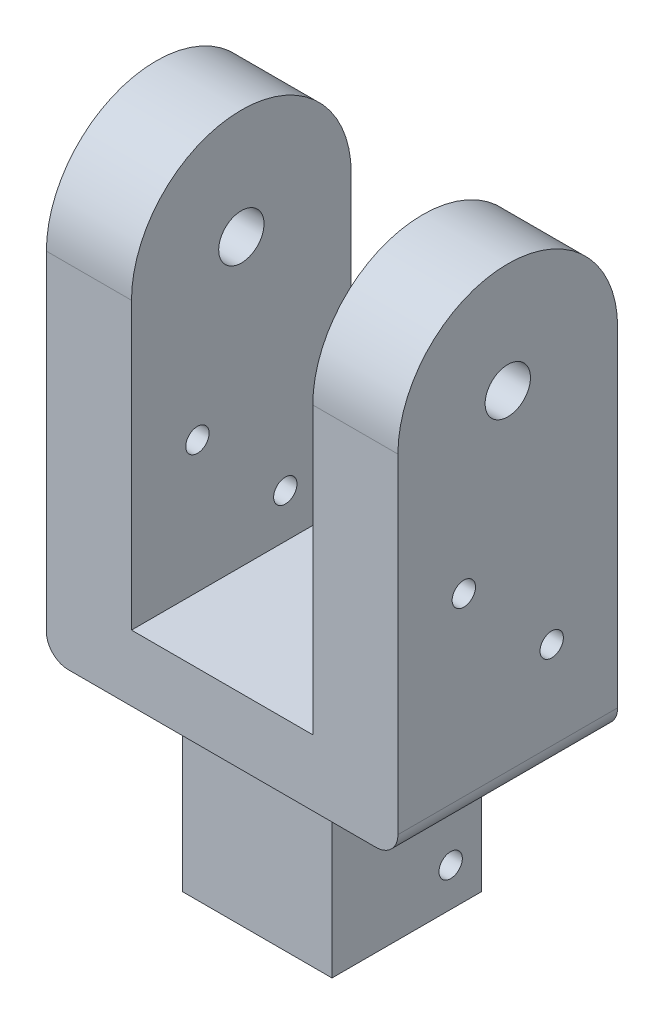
ISO-10303-21;
HEADER;
FILE_DESCRIPTION(('STEP AP214'),'2;1');
FILE_NAME('part.step','',(''),(''),'','','');
FILE_SCHEMA(('AUTOMOTIVE_DESIGN { 1 0 10303 214 1 1 1 1 }'));
ENDSEC;
DATA;
#1=APPLICATION_CONTEXT('core data for automotive mechanical design processes');
#2=APPLICATION_PROTOCOL_DEFINITION('international standard','automotive_design',2000,#1);
#3=PRODUCT_CONTEXT('',#1,'mechanical');
#4=PRODUCT('Part','Part','',(#3));
#5=PRODUCT_RELATED_PRODUCT_CATEGORY('part','',(#4));
#6=PRODUCT_DEFINITION_FORMATION('','',#4);
#7=PRODUCT_DEFINITION_CONTEXT('part definition',#1,'design');
#8=PRODUCT_DEFINITION('design','',#6,#7);
#9=PRODUCT_DEFINITION_SHAPE('','',#8);
#10=(LENGTH_UNIT() NAMED_UNIT(*) SI_UNIT(.MILLI.,.METRE.));
#11=(NAMED_UNIT(*) PLANE_ANGLE_UNIT() SI_UNIT($,.RADIAN.));
#12=(NAMED_UNIT(*) SI_UNIT($,.STERADIAN.) SOLID_ANGLE_UNIT());
#13=UNCERTAINTY_MEASURE_WITH_UNIT(LENGTH_MEASURE(1.E-05),#10,'distance_accuracy_value','');
#14=(GEOMETRIC_REPRESENTATION_CONTEXT(3) GLOBAL_UNCERTAINTY_ASSIGNED_CONTEXT((#13)) GLOBAL_UNIT_ASSIGNED_CONTEXT((#10,
#11,#12)) REPRESENTATION_CONTEXT('',''));
#15=CARTESIAN_POINT('',(0.,0.,0.));
#16=DIRECTION('',(0.,0.,1.));
#17=DIRECTION('',(1.,0.,0.));
#18=AXIS2_PLACEMENT_3D('',#15,#16,#17);
#19=CARTESIAN_POINT('',(101.6,0.,0.));
#20=DIRECTION('',(-1.,0.,0.));
#21=DIRECTION('',(0.,0.,1.));
#22=AXIS2_PLACEMENT_3D('',#19,#20,#21);
#23=CYLINDRICAL_SURFACE('',#22,31.75);
#24=DIRECTION('',(-1.,0.,0.));
#25=VECTOR('',#24,1.);
#26=CARTESIAN_POINT('',(101.6,0.,31.7499999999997));
#27=LINE('',#26,#25);
#28=CARTESIAN_POINT('',(24.6062500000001,0.,31.7499999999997));
#29=VERTEX_POINT('',#28);
#30=CARTESIAN_POINT('',(0.,0.,31.7499999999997));
#31=VERTEX_POINT('',#30);
#32=EDGE_CURVE('E239',#29,#31,#27,.T.);
#33=ORIENTED_EDGE('',*,*,#32,.F.);
#34=CARTESIAN_POINT('',(24.6062500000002,0.,0.));
#35=DIRECTION('',(-1.,0.,0.));
#36=DIRECTION('',(0.,-1.,0.));
#37=AXIS2_PLACEMENT_3D('',#34,#35,#36);
#38=CIRCLE('',#37,31.75);
#39=CARTESIAN_POINT('',(24.6062500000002,0.,-31.7499999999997));
#40=VERTEX_POINT('',#39);
#41=EDGE_CURVE('E188',#29,#40,#38,.T.);
#42=ORIENTED_EDGE('',*,*,#41,.T.);
#43=DIRECTION('',(-1.,0.,0.));
#44=VECTOR('',#43,1.);
#45=CARTESIAN_POINT('',(101.6,0.,-31.7499999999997));
#46=LINE('',#45,#44);
#47=CARTESIAN_POINT('',(1.11022302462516E-13,0.,-31.7499999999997));
#48=VERTEX_POINT('',#47);
#49=EDGE_CURVE('E169',#40,#48,#46,.T.);
#50=ORIENTED_EDGE('',*,*,#49,.T.);
#51=CARTESIAN_POINT('',(1.11022302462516E-13,0.,0.));
#52=DIRECTION('',(1.,0.,0.));
#53=DIRECTION('',(0.,0.,-1.));
#54=AXIS2_PLACEMENT_3D('',#51,#52,#53);
#55=CIRCLE('',#54,31.75);
#56=EDGE_CURVE('E218',#48,#31,#55,.T.);
#57=ORIENTED_EDGE('',*,*,#56,.T.);
#58=EDGE_LOOP('',(#33,#42,#50,#57));
#59=FACE_BOUND('',#58,.T.);
#60=ADVANCED_FACE('F30',(#59),#23,.T.);
#61=CARTESIAN_POINT('',(101.6,0.,0.));
#62=DIRECTION('',(-1.,0.,0.));
#63=DIRECTION('',(0.,0.,1.));
#64=AXIS2_PLACEMENT_3D('',#61,#62,#63);
#65=CYLINDRICAL_SURFACE('',#64,6.54812);
#66=CARTESIAN_POINT('',(24.6062500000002,0.,0.));
#67=DIRECTION('',(-1.,0.,0.));
#68=DIRECTION('',(0.,-1.,0.));
#69=AXIS2_PLACEMENT_3D('',#66,#67,#68);
#70=CIRCLE('',#69,6.54812);
#71=CARTESIAN_POINT('',(24.6062500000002,-6.54812000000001,0.));
#72=VERTEX_POINT('',#71);
#73=EDGE_CURVE('E187',#72,#72,#70,.T.);
#74=ORIENTED_EDGE('',*,*,#73,.F.);
#75=EDGE_LOOP('',(#74));
#76=FACE_BOUND('',#75,.T.);
#77=CARTESIAN_POINT('',(1.11022302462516E-13,0.,0.));
#78=DIRECTION('',(1.,0.,0.));
#79=DIRECTION('',(0.,0.,-1.));
#80=AXIS2_PLACEMENT_3D('',#77,#78,#79);
#81=CIRCLE('',#80,6.54812);
#82=CARTESIAN_POINT('',(1.11015226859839E-13,0.,-6.54812));
#83=VERTEX_POINT('',#82);
#84=EDGE_CURVE('E214',#83,#83,#81,.T.);
#85=ORIENTED_EDGE('',*,*,#84,.F.);
#86=EDGE_LOOP('',(#85));
#87=FACE_BOUND('',#86,.T.);
#88=ADVANCED_FACE('F363',(#76,#87),#65,.F.);
#89=CARTESIAN_POINT('',(101.6,0.,0.));
#90=DIRECTION('',(1.,0.,0.));
#91=DIRECTION('',(0.,0.,-1.));
#92=AXIS2_PLACEMENT_3D('',#89,#90,#91);
#93=PLANE('',#92);
#94=CARTESIAN_POINT('',(101.6,-69.85,-12.6999999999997));
#95=DIRECTION('',(-1.,0.,0.));
#96=DIRECTION('',(0.,0.,1.));
#97=AXIS2_PLACEMENT_3D('',#94,#95,#96);
#98=CIRCLE('',#97,3.37312);
#99=CARTESIAN_POINT('',(101.6,-69.85,-9.32687999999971));
#100=VERTEX_POINT('',#99);
#101=EDGE_CURVE('E559',#100,#100,#98,.T.);
#102=ORIENTED_EDGE('',*,*,#101,.T.);
#103=EDGE_LOOP('',(#102));
#104=FACE_BOUND('',#103,.T.);
#105=CARTESIAN_POINT('',(101.6,-44.45,12.6999999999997));
#106=DIRECTION('',(-1.,0.,0.));
#107=DIRECTION('',(0.,0.,1.));
#108=AXIS2_PLACEMENT_3D('',#105,#106,#107);
#109=CIRCLE('',#108,3.37312);
#110=CARTESIAN_POINT('',(101.6,-44.45,16.0731199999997));
#111=VERTEX_POINT('',#110);
#112=EDGE_CURVE('E300',#111,#111,#109,.T.);
#113=ORIENTED_EDGE('',*,*,#112,.T.);
#114=EDGE_LOOP('',(#113));
#115=FACE_BOUND('',#114,.T.);
#116=CARTESIAN_POINT('',(101.6,0.,0.));
#117=DIRECTION('',(1.,0.,0.));
#118=DIRECTION('',(0.,0.,-1.));
#119=AXIS2_PLACEMENT_3D('',#116,#117,#118);
#120=CIRCLE('',#119,6.54812);
#121=CARTESIAN_POINT('',(101.6,0.,-6.54812));
#122=VERTEX_POINT('',#121);
#123=EDGE_CURVE('E215',#122,#122,#120,.T.);
#124=ORIENTED_EDGE('',*,*,#123,.F.);
#125=EDGE_LOOP('',(#124));
#126=FACE_BOUND('',#125,.T.);
#127=DIRECTION('',(0.,-1.,0.));
#128=VECTOR('',#127,1.);
#129=CARTESIAN_POINT('',(101.6,0.,31.7499999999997));
#130=LINE('',#129,#128);
#131=CARTESIAN_POINT('',(101.6,0.,31.7499999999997));
#132=VERTEX_POINT('',#131);
#133=CARTESIAN_POINT('',(101.6,-95.2500000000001,31.7499999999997));
#134=VERTEX_POINT('',#133);
#135=EDGE_CURVE('E224',#132,#134,#130,.T.);
#136=ORIENTED_EDGE('',*,*,#135,.T.);
#137=DIRECTION('',(0.,0.,-1.));
#138=VECTOR('',#137,1.);
#139=CARTESIAN_POINT('',(101.6,-95.2500000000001,0.));
#140=LINE('',#139,#138);
#141=CARTESIAN_POINT('',(101.6,-95.2500000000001,-31.7499999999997));
#142=VERTEX_POINT('',#141);
#143=EDGE_CURVE('E246',#134,#142,#140,.T.);
#144=ORIENTED_EDGE('',*,*,#143,.T.);
#145=DIRECTION('',(0.,1.,0.));
#146=VECTOR('',#145,1.);
#147=CARTESIAN_POINT('',(101.6,0.,-31.7499999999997));
#148=LINE('',#147,#146);
#149=CARTESIAN_POINT('',(101.6,0.,-31.7499999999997));
#150=VERTEX_POINT('',#149);
#151=EDGE_CURVE('E228',#142,#150,#148,.T.);
#152=ORIENTED_EDGE('',*,*,#151,.T.);
#153=CARTESIAN_POINT('',(101.6,0.,0.));
#154=DIRECTION('',(1.,0.,0.));
#155=DIRECTION('',(0.,0.,-1.));
#156=AXIS2_PLACEMENT_3D('',#153,#154,#155);
#157=CIRCLE('',#156,31.75);
#158=EDGE_CURVE('E221',#150,#132,#157,.T.);
#159=ORIENTED_EDGE('',*,*,#158,.T.);
#160=EDGE_LOOP('',(#136,#144,#152,#159));
#161=FACE_BOUND('',#160,.T.);
#162=ADVANCED_FACE('F370',(#104,#115,#126,#161),#93,.T.);
#163=CARTESIAN_POINT('',(1.11022302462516E-13,0.,0.));
#164=DIRECTION('',(1.,0.,0.));
#165=DIRECTION('',(0.,0.,-1.));
#166=AXIS2_PLACEMENT_3D('',#163,#164,#165);
#167=PLANE('',#166);
#168=CARTESIAN_POINT('',(1.11022302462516E-13,-69.85,-12.6999999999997));
#169=DIRECTION('',(-1.,0.,0.));
#170=DIRECTION('',(0.,0.,1.));
#171=AXIS2_PLACEMENT_3D('',#168,#169,#170);
#172=CIRCLE('',#171,3.37312);
#173=CARTESIAN_POINT('',(1.11025947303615E-13,-69.85,-9.32687999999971));
#174=VERTEX_POINT('',#173);
#175=EDGE_CURVE('E555',#174,#174,#172,.T.);
#176=ORIENTED_EDGE('',*,*,#175,.F.);
#177=EDGE_LOOP('',(#176));
#178=FACE_BOUND('',#177,.T.);
#179=CARTESIAN_POINT('',(0.,-44.45,12.6999999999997));
#180=DIRECTION('',(-1.,0.,0.));
#181=DIRECTION('',(0.,0.,1.));
#182=AXIS2_PLACEMENT_3D('',#179,#180,#181);
#183=CIRCLE('',#182,3.37312);
#184=CARTESIAN_POINT('',(0.,-44.45,16.0731199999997));
#185=VERTEX_POINT('',#184);
#186=EDGE_CURVE('E306',#185,#185,#183,.T.);
#187=ORIENTED_EDGE('',*,*,#186,.F.);
#188=EDGE_LOOP('',(#187));
#189=FACE_BOUND('',#188,.T.);
#190=ORIENTED_EDGE('',*,*,#84,.T.);
#191=EDGE_LOOP('',(#190));
#192=FACE_BOUND('',#191,.T.);
#193=DIRECTION('',(0.,1.,0.));
#194=VECTOR('',#193,1.);
#195=CARTESIAN_POINT('',(1.11022302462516E-13,0.,-31.7499999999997));
#196=LINE('',#195,#194);
#197=CARTESIAN_POINT('',(1.11022302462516E-13,-95.2500000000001,-31.7499999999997));
#198=VERTEX_POINT('',#197);
#199=EDGE_CURVE('E225',#198,#48,#196,.T.);
#200=ORIENTED_EDGE('',*,*,#199,.F.);
#201=DIRECTION('',(0.,0.,-1.));
#202=VECTOR('',#201,1.);
#203=CARTESIAN_POINT('',(0.,-95.2500000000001,31.7499999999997));
#204=LINE('',#203,#202);
#205=CARTESIAN_POINT('',(0.,-95.2500000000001,31.7499999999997));
#206=VERTEX_POINT('',#205);
#207=EDGE_CURVE('E272',#198,#206,#204,.F.);
#208=ORIENTED_EDGE('',*,*,#207,.T.);
#209=DIRECTION('',(0.,-1.,0.));
#210=VECTOR('',#209,1.);
#211=CARTESIAN_POINT('',(0.,0.,31.7499999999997));
#212=LINE('',#211,#210);
#213=EDGE_CURVE('E232',#31,#206,#212,.T.);
#214=ORIENTED_EDGE('',*,*,#213,.F.);
#215=ORIENTED_EDGE('',*,*,#56,.F.);
#216=EDGE_LOOP('',(#200,#208,#214,#215));
#217=FACE_BOUND('',#216,.T.);
#218=ADVANCED_FACE('F409',(#178,#189,#192,#217),#167,.F.);
#219=CARTESIAN_POINT('',(101.6,0.,31.7499999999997));
#220=DIRECTION('',(0.,0.,-1.));
#221=DIRECTION('',(0.,1.,0.));
#222=AXIS2_PLACEMENT_3D('',#219,#220,#221);
#223=PLANE('',#222);
#224=DIRECTION('',(-1.,0.,0.));
#225=VECTOR('',#224,1.);
#226=CARTESIAN_POINT('',(101.6,-101.6,31.7499999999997));
#227=LINE('',#226,#225);
#228=CARTESIAN_POINT('',(95.25,-101.6,31.7499999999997));
#229=VERTEX_POINT('',#228);
#230=CARTESIAN_POINT('',(6.35000000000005,-101.6,31.7499999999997));
#231=VERTEX_POINT('',#230);
#232=EDGE_CURVE('E206',#229,#231,#227,.T.);
#233=ORIENTED_EDGE('',*,*,#232,.F.);
#234=CARTESIAN_POINT('',(95.2500000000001,-95.2500000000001,31.7499999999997));
#235=DIRECTION('',(0.,0.,-1.));
#236=DIRECTION('',(0.,1.,0.));
#237=AXIS2_PLACEMENT_3D('',#234,#235,#236);
#238=CIRCLE('',#237,6.35);
#239=EDGE_CURVE('E270',#229,#134,#238,.F.);
#240=ORIENTED_EDGE('',*,*,#239,.T.);
#241=ORIENTED_EDGE('',*,*,#135,.F.);
#242=CARTESIAN_POINT('',(76.9937500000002,0.,31.7499999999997));
#243=VERTEX_POINT('',#242);
#244=EDGE_CURVE('E240',#132,#243,#27,.T.);
#245=ORIENTED_EDGE('',*,*,#244,.T.);
#246=DIRECTION('',(0.,1.,0.));
#247=VECTOR('',#246,1.);
#248=CARTESIAN_POINT('',(76.9937500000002,35.691683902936,31.7499999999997));
#249=LINE('',#248,#247);
#250=CARTESIAN_POINT('',(76.9937500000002,-82.55,31.7499999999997));
#251=VERTEX_POINT('',#250);
#252=EDGE_CURVE('E170',#251,#243,#249,.T.);
#253=ORIENTED_EDGE('',*,*,#252,.F.);
#254=DIRECTION('',(1.,0.,0.));
#255=VECTOR('',#254,1.);
#256=CARTESIAN_POINT('',(24.6062500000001,-82.55,31.7499999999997));
#257=LINE('',#256,#255);
#258=CARTESIAN_POINT('',(24.6062500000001,-82.55,31.7499999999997));
#259=VERTEX_POINT('',#258);
#260=EDGE_CURVE('E172',#259,#251,#257,.T.);
#261=ORIENTED_EDGE('',*,*,#260,.F.);
#262=DIRECTION('',(0.,-1.,0.));
#263=VECTOR('',#262,1.);
#264=CARTESIAN_POINT('',(24.6062500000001,35.691683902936,31.7499999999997));
#265=LINE('',#264,#263);
#266=EDGE_CURVE('E151',#29,#259,#265,.T.);
#267=ORIENTED_EDGE('',*,*,#266,.F.);
#268=ORIENTED_EDGE('',*,*,#32,.T.);
#269=ORIENTED_EDGE('',*,*,#213,.T.);
#270=CARTESIAN_POINT('',(6.35000000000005,-95.2500000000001,31.7499999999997));
#271=DIRECTION('',(0.,0.,-1.));
#272=DIRECTION('',(0.,1.,0.));
#273=AXIS2_PLACEMENT_3D('',#270,#271,#272);
#274=CIRCLE('',#273,6.35);
#275=EDGE_CURVE('E268',#206,#231,#274,.F.);
#276=ORIENTED_EDGE('',*,*,#275,.T.);
#277=EDGE_LOOP('',(#233,#240,#241,#245,#253,#261,#267,#268,#269,#276));
#278=FACE_BOUND('',#277,.T.);
#279=ADVANCED_FACE('F384',(#278),#223,.F.);
#280=CARTESIAN_POINT('',(101.6,0.,-31.7499999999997));
#281=DIRECTION('',(0.,0.,1.));
#282=DIRECTION('',(0.,-1.,0.));
#283=AXIS2_PLACEMENT_3D('',#280,#281,#282);
#284=PLANE('',#283);
#285=ORIENTED_EDGE('',*,*,#151,.F.);
#286=CARTESIAN_POINT('',(95.2500000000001,-95.2500000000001,-31.7499999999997));
#287=DIRECTION('',(0.,0.,1.));
#288=DIRECTION('',(0.,-1.,0.));
#289=AXIS2_PLACEMENT_3D('',#286,#287,#288);
#290=CIRCLE('',#289,6.35);
#291=CARTESIAN_POINT('',(95.2500000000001,-101.6,-31.7499999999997));
#292=VERTEX_POINT('',#291);
#293=EDGE_CURVE('E261',#142,#292,#290,.F.);
#294=ORIENTED_EDGE('',*,*,#293,.T.);
#295=DIRECTION('',(1.,0.,0.));
#296=VECTOR('',#295,1.);
#297=CARTESIAN_POINT('',(101.6,-101.6,-31.7499999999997));
#298=LINE('',#297,#296);
#299=CARTESIAN_POINT('',(6.35000000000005,-101.6,-31.7499999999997));
#300=VERTEX_POINT('',#299);
#301=EDGE_CURVE('E243',#300,#292,#298,.T.);
#302=ORIENTED_EDGE('',*,*,#301,.F.);
#303=CARTESIAN_POINT('',(6.35000000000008,-95.2500000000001,-31.7499999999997));
#304=DIRECTION('',(0.,0.,1.));
#305=DIRECTION('',(0.,-1.,0.));
#306=AXIS2_PLACEMENT_3D('',#303,#304,#305);
#307=CIRCLE('',#306,6.35);
#308=EDGE_CURVE('E259',#300,#198,#307,.F.);
#309=ORIENTED_EDGE('',*,*,#308,.T.);
#310=ORIENTED_EDGE('',*,*,#199,.T.);
#311=ORIENTED_EDGE('',*,*,#49,.F.);
#312=DIRECTION('',(0.,-1.,0.));
#313=VECTOR('',#312,1.);
#314=CARTESIAN_POINT('',(24.6062500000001,35.691683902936,-31.7499999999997));
#315=LINE('',#314,#313);
#316=CARTESIAN_POINT('',(24.6062500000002,-82.55,-31.7499999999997));
#317=VERTEX_POINT('',#316);
#318=EDGE_CURVE('E148',#40,#317,#315,.T.);
#319=ORIENTED_EDGE('',*,*,#318,.T.);
#320=DIRECTION('',(1.,0.,0.));
#321=VECTOR('',#320,1.);
#322=CARTESIAN_POINT('',(24.6062500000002,-82.55,-31.7499999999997));
#323=LINE('',#322,#321);
#324=CARTESIAN_POINT('',(76.9937500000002,-82.55,-31.7499999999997));
#325=VERTEX_POINT('',#324);
#326=EDGE_CURVE('E159',#317,#325,#323,.T.);
#327=ORIENTED_EDGE('',*,*,#326,.T.);
#328=DIRECTION('',(0.,1.,0.));
#329=VECTOR('',#328,1.);
#330=CARTESIAN_POINT('',(76.9937500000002,35.691683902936,-31.7499999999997));
#331=LINE('',#330,#329);
#332=CARTESIAN_POINT('',(76.9937500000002,0.,-31.7499999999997));
#333=VERTEX_POINT('',#332);
#334=EDGE_CURVE('E156',#325,#333,#331,.T.);
#335=ORIENTED_EDGE('',*,*,#334,.T.);
#336=EDGE_CURVE('E236',#150,#333,#46,.T.);
#337=ORIENTED_EDGE('',*,*,#336,.F.);
#338=EDGE_LOOP('',(#285,#294,#302,#309,#310,#311,#319,#327,#335,#337));
#339=FACE_BOUND('',#338,.T.);
#340=ADVANCED_FACE('F167',(#339),#284,.F.);
#341=ORIENTED_EDGE('',*,*,#336,.T.);
#342=CARTESIAN_POINT('',(76.9937500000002,0.,0.));
#343=DIRECTION('',(1.,0.,0.));
#344=DIRECTION('',(0.,1.,0.));
#345=AXIS2_PLACEMENT_3D('',#342,#343,#344);
#346=CIRCLE('',#345,31.75);
#347=EDGE_CURVE('E184',#333,#243,#346,.T.);
#348=ORIENTED_EDGE('',*,*,#347,.T.);
#349=ORIENTED_EDGE('',*,*,#244,.F.);
#350=ORIENTED_EDGE('',*,*,#158,.F.);
#351=EDGE_LOOP('',(#341,#348,#349,#350));
#352=FACE_BOUND('',#351,.T.);
#353=ADVANCED_FACE('F366',(#352),#23,.T.);
#354=CARTESIAN_POINT('',(76.9937500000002,0.,0.));
#355=DIRECTION('',(1.,0.,0.));
#356=DIRECTION('',(0.,1.,0.));
#357=AXIS2_PLACEMENT_3D('',#354,#355,#356);
#358=CIRCLE('',#357,6.54812);
#359=CARTESIAN_POINT('',(76.9937500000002,6.54811999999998,0.));
#360=VERTEX_POINT('',#359);
#361=EDGE_CURVE('E182',#360,#360,#358,.T.);
#362=ORIENTED_EDGE('',*,*,#361,.F.);
#363=EDGE_LOOP('',(#362));
#364=FACE_BOUND('',#363,.T.);
#365=ORIENTED_EDGE('',*,*,#123,.T.);
#366=EDGE_LOOP('',(#365));
#367=FACE_BOUND('',#366,.T.);
#368=ADVANCED_FACE('F373',(#364,#367),#65,.F.);
#369=CARTESIAN_POINT('',(-16.5907053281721,-101.6,-43.0906749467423));
#370=DIRECTION('',(0.,-1.,0.));
#371=DIRECTION('',(0.,0.,-1.));
#372=AXIS2_PLACEMENT_3D('',#369,#370,#371);
#373=PLANE('',#372);
#374=DIRECTION('',(-1.,0.,0.));
#375=VECTOR('',#374,1.);
#376=CARTESIAN_POINT('',(29.2100000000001,-101.6,21.5899999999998));
#377=LINE('',#376,#375);
#378=CARTESIAN_POINT('',(72.3899999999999,-101.6,21.5899999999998));
#379=VERTEX_POINT('',#378);
#380=CARTESIAN_POINT('',(29.2100000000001,-101.6,21.5899999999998));
#381=VERTEX_POINT('',#380);
#382=EDGE_CURVE('E199',#379,#381,#377,.T.);
#383=ORIENTED_EDGE('',*,*,#382,.F.);
#384=DIRECTION('',(0.,0.,1.));
#385=VECTOR('',#384,1.);
#386=CARTESIAN_POINT('',(72.3899999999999,-101.6,21.5899999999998));
#387=LINE('',#386,#385);
#388=CARTESIAN_POINT('',(72.3900000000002,-101.6,-21.5899999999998));
#389=VERTEX_POINT('',#388);
#390=EDGE_CURVE('E196',#389,#379,#387,.T.);
#391=ORIENTED_EDGE('',*,*,#390,.F.);
#392=DIRECTION('',(1.,0.,0.));
#393=VECTOR('',#392,1.);
#394=CARTESIAN_POINT('',(29.21,-101.6,-21.5899999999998));
#395=LINE('',#394,#393);
#396=CARTESIAN_POINT('',(29.21,-101.6,-21.5899999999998));
#397=VERTEX_POINT('',#396);
#398=EDGE_CURVE('E193',#397,#389,#395,.T.);
#399=ORIENTED_EDGE('',*,*,#398,.F.);
#400=DIRECTION('',(0.,0.,-1.));
#401=VECTOR('',#400,1.);
#402=CARTESIAN_POINT('',(29.2100000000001,-101.6,21.5899999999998));
#403=LINE('',#402,#401);
#404=EDGE_CURVE('E190',#381,#397,#403,.T.);
#405=ORIENTED_EDGE('',*,*,#404,.F.);
#406=EDGE_LOOP('',(#383,#391,#399,#405));
#407=FACE_BOUND('',#406,.T.);
#408=ORIENTED_EDGE('',*,*,#301,.T.);
#409=DIRECTION('',(0.,0.,-1.));
#410=VECTOR('',#409,1.);
#411=CARTESIAN_POINT('',(95.25,-101.6,-43.0906749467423));
#412=LINE('',#411,#410);
#413=EDGE_CURVE('E266',#292,#229,#412,.F.);
#414=ORIENTED_EDGE('',*,*,#413,.T.);
#415=ORIENTED_EDGE('',*,*,#232,.T.);
#416=DIRECTION('',(0.,0.,-1.));
#417=VECTOR('',#416,1.);
#418=CARTESIAN_POINT('',(6.35000000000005,-101.6,-31.7499999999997));
#419=LINE('',#418,#417);
#420=EDGE_CURVE('E263',#231,#300,#419,.T.);
#421=ORIENTED_EDGE('',*,*,#420,.T.);
#422=EDGE_LOOP('',(#408,#414,#415,#421));
#423=FACE_BOUND('',#422,.T.);
#424=ADVANCED_FACE('F324',(#407,#423),#373,.T.);
#425=CARTESIAN_POINT('',(29.2100000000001,-101.6,21.5899999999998));
#426=DIRECTION('',(-1.,0.,0.));
#427=DIRECTION('',(0.,0.,1.));
#428=AXIS2_PLACEMENT_3D('',#425,#426,#427);
#429=PLANE('',#428);
#430=CARTESIAN_POINT('',(29.2100000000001,-139.7,-12.6999999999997));
#431=DIRECTION('',(-1.,0.,0.));
#432=DIRECTION('',(0.,0.,1.));
#433=AXIS2_PLACEMENT_3D('',#430,#431,#432);
#434=CIRCLE('',#433,3.37311999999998);
#435=CARTESIAN_POINT('',(29.2100000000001,-139.7,-9.32687999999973));
#436=VERTEX_POINT('',#435);
#437=EDGE_CURVE('E256',#436,#436,#434,.T.);
#438=ORIENTED_EDGE('',*,*,#437,.F.);
#439=EDGE_LOOP('',(#438));
#440=FACE_BOUND('',#439,.T.);
#441=CARTESIAN_POINT('',(29.2100000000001,-114.3,12.6999999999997));
#442=DIRECTION('',(-1.,0.,0.));
#443=DIRECTION('',(0.,0.,1.));
#444=AXIS2_PLACEMENT_3D('',#441,#442,#443);
#445=CIRCLE('',#444,3.37311999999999);
#446=CARTESIAN_POINT('',(29.2100000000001,-114.3,16.0731199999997));
#447=VERTEX_POINT('',#446);
#448=EDGE_CURVE('E175',#447,#447,#445,.T.);
#449=ORIENTED_EDGE('',*,*,#448,.F.);
#450=EDGE_LOOP('',(#449));
#451=FACE_BOUND('',#450,.T.);
#452=DIRECTION('',(0.,-1.,0.));
#453=VECTOR('',#452,1.);
#454=CARTESIAN_POINT('',(29.21,-101.6,-21.5899999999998));
#455=LINE('',#454,#453);
#456=CARTESIAN_POINT('',(29.21,-150.8125,-21.5899999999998));
#457=VERTEX_POINT('',#456);
#458=EDGE_CURVE('E202',#397,#457,#455,.T.);
#459=ORIENTED_EDGE('',*,*,#458,.T.);
#460=DIRECTION('',(0.,0.,1.));
#461=VECTOR('',#460,1.);
#462=CARTESIAN_POINT('',(29.2100000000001,-150.8125,21.5899999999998));
#463=LINE('',#462,#461);
#464=CARTESIAN_POINT('',(29.2100000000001,-150.8125,21.5899999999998));
#465=VERTEX_POINT('',#464);
#466=EDGE_CURVE('E11',#457,#465,#463,.T.);
#467=ORIENTED_EDGE('',*,*,#466,.T.);
#468=DIRECTION('',(0.,-1.,0.));
#469=VECTOR('',#468,1.);
#470=CARTESIAN_POINT('',(29.2100000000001,-101.6,21.5899999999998));
#471=LINE('',#470,#469);
#472=EDGE_CURVE('E203',#381,#465,#471,.T.);
#473=ORIENTED_EDGE('',*,*,#472,.F.);
#474=ORIENTED_EDGE('',*,*,#404,.T.);
#475=EDGE_LOOP('',(#459,#467,#473,#474));
#476=FACE_BOUND('',#475,.T.);
#477=ADVANCED_FACE('F320',(#440,#451,#476),#429,.T.);
#478=CARTESIAN_POINT('',(29.2100000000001,-101.6,21.5899999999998));
#479=DIRECTION('',(0.,0.,1.));
#480=DIRECTION('',(0.,-1.,0.));
#481=AXIS2_PLACEMENT_3D('',#478,#479,#480);
#482=PLANE('',#481);
#483=ORIENTED_EDGE('',*,*,#472,.T.);
#484=DIRECTION('',(1.,0.,0.));
#485=VECTOR('',#484,1.);
#486=CARTESIAN_POINT('',(72.3899999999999,-150.8125,21.5899999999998));
#487=LINE('',#486,#485);
#488=CARTESIAN_POINT('',(72.3899999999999,-150.8125,21.5899999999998));
#489=VERTEX_POINT('',#488);
#490=EDGE_CURVE('E283',#465,#489,#487,.T.);
#491=ORIENTED_EDGE('',*,*,#490,.T.);
#492=DIRECTION('',(0.,-1.,0.));
#493=VECTOR('',#492,1.);
#494=CARTESIAN_POINT('',(72.3899999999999,-101.6,21.5899999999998));
#495=LINE('',#494,#493);
#496=EDGE_CURVE('E207',#379,#489,#495,.T.);
#497=ORIENTED_EDGE('',*,*,#496,.F.);
#498=ORIENTED_EDGE('',*,*,#382,.T.);
#499=EDGE_LOOP('',(#483,#491,#497,#498));
#500=FACE_BOUND('',#499,.T.);
#501=ADVANCED_FACE('F323',(#500),#482,.T.);
#502=CARTESIAN_POINT('',(72.3899999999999,-101.6,21.5899999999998));
#503=DIRECTION('',(1.,0.,0.));
#504=DIRECTION('',(0.,0.,-1.));
#505=AXIS2_PLACEMENT_3D('',#502,#503,#504);
#506=PLANE('',#505);
#507=CARTESIAN_POINT('',(72.3900000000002,-139.7,-12.6999999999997));
#508=DIRECTION('',(1.,0.,0.));
#509=DIRECTION('',(0.,0.,-1.));
#510=AXIS2_PLACEMENT_3D('',#507,#508,#509);
#511=CIRCLE('',#510,3.37311999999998);
#512=CARTESIAN_POINT('',(72.3900000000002,-139.7,-16.0731199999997));
#513=VERTEX_POINT('',#512);
#514=EDGE_CURVE('E253',#513,#513,#511,.T.);
#515=ORIENTED_EDGE('',*,*,#514,.F.);
#516=EDGE_LOOP('',(#515));
#517=FACE_BOUND('',#516,.T.);
#518=CARTESIAN_POINT('',(72.3899999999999,-114.3,12.6999999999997));
#519=DIRECTION('',(1.,0.,0.));
#520=DIRECTION('',(0.,0.,-1.));
#521=AXIS2_PLACEMENT_3D('',#518,#519,#520);
#522=CIRCLE('',#521,3.37311999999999);
#523=CARTESIAN_POINT('',(72.3899999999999,-114.3,9.32687999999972));
#524=VERTEX_POINT('',#523);
#525=EDGE_CURVE('E180',#524,#524,#522,.T.);
#526=ORIENTED_EDGE('',*,*,#525,.F.);
#527=EDGE_LOOP('',(#526));
#528=FACE_BOUND('',#527,.T.);
#529=ORIENTED_EDGE('',*,*,#496,.T.);
#530=DIRECTION('',(0.,0.,-1.));
#531=VECTOR('',#530,1.);
#532=CARTESIAN_POINT('',(72.3900000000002,-150.8125,-21.5899999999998));
#533=LINE('',#532,#531);
#534=CARTESIAN_POINT('',(72.3900000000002,-150.8125,-21.5899999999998));
#535=VERTEX_POINT('',#534);
#536=EDGE_CURVE('E54',#489,#535,#533,.T.);
#537=ORIENTED_EDGE('',*,*,#536,.T.);
#538=DIRECTION('',(0.,-1.,0.));
#539=VECTOR('',#538,1.);
#540=CARTESIAN_POINT('',(72.3900000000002,-101.6,-21.5899999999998));
#541=LINE('',#540,#539);
#542=EDGE_CURVE('E209',#389,#535,#541,.T.);
#543=ORIENTED_EDGE('',*,*,#542,.F.);
#544=ORIENTED_EDGE('',*,*,#390,.T.);
#545=EDGE_LOOP('',(#529,#537,#543,#544));
#546=FACE_BOUND('',#545,.T.);
#547=ADVANCED_FACE('F347',(#517,#528,#546),#506,.T.);
#548=CARTESIAN_POINT('',(29.21,-101.6,-21.5899999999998));
#549=DIRECTION('',(0.,0.,-1.));
#550=DIRECTION('',(0.,1.,0.));
#551=AXIS2_PLACEMENT_3D('',#548,#549,#550);
#552=PLANE('',#551);
#553=ORIENTED_EDGE('',*,*,#542,.T.);
#554=DIRECTION('',(-1.,0.,0.));
#555=VECTOR('',#554,1.);
#556=CARTESIAN_POINT('',(29.21,-150.8125,-21.5899999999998));
#557=LINE('',#556,#555);
#558=EDGE_CURVE('E39',#535,#457,#557,.T.);
#559=ORIENTED_EDGE('',*,*,#558,.T.);
#560=ORIENTED_EDGE('',*,*,#458,.F.);
#561=ORIENTED_EDGE('',*,*,#398,.T.);
#562=EDGE_LOOP('',(#553,#559,#560,#561));
#563=FACE_BOUND('',#562,.T.);
#564=ADVANCED_FACE('F350',(#563),#552,.T.);
#565=CARTESIAN_POINT('',(101.6,-152.4,-31.7499999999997));
#566=DIRECTION('',(0.,1.,0.));
#567=DIRECTION('',(0.,0.,1.));
#568=AXIS2_PLACEMENT_3D('',#565,#566,#567);
#569=PLANE('',#568);
#570=DIRECTION('',(0.,0.,1.));
#571=VECTOR('',#570,1.);
#572=CARTESIAN_POINT('',(70.8025000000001,-152.4,21.5899999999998));
#573=LINE('',#572,#571);
#574=CARTESIAN_POINT('',(70.8025000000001,-152.4,-20.0024999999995));
#575=VERTEX_POINT('',#574);
#576=CARTESIAN_POINT('',(70.8025000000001,-152.4,20.0025000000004));
#577=VERTEX_POINT('',#576);
#578=EDGE_CURVE('E278',#575,#577,#573,.T.);
#579=ORIENTED_EDGE('',*,*,#578,.T.);
#580=DIRECTION('',(-1.,0.,0.));
#581=VECTOR('',#580,1.);
#582=CARTESIAN_POINT('',(29.2100000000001,-152.4,20.0025000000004));
#583=LINE('',#582,#581);
#584=CARTESIAN_POINT('',(30.7975,-152.4,20.0025000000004));
#585=VERTEX_POINT('',#584);
#586=EDGE_CURVE('E280',#577,#585,#583,.T.);
#587=ORIENTED_EDGE('',*,*,#586,.T.);
#588=DIRECTION('',(0.,0.,-1.));
#589=VECTOR('',#588,1.);
#590=CARTESIAN_POINT('',(30.7975,-152.4,-21.5899999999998));
#591=LINE('',#590,#589);
#592=CARTESIAN_POINT('',(30.7975,-152.4,-20.0024999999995));
#593=VERTEX_POINT('',#592);
#594=EDGE_CURVE('E274',#585,#593,#591,.T.);
#595=ORIENTED_EDGE('',*,*,#594,.T.);
#596=DIRECTION('',(1.,0.,0.));
#597=VECTOR('',#596,1.);
#598=CARTESIAN_POINT('',(72.3900000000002,-152.4,-20.0024999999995));
#599=LINE('',#598,#597);
#600=EDGE_CURVE('E276',#593,#575,#599,.T.);
#601=ORIENTED_EDGE('',*,*,#600,.T.);
#602=EDGE_LOOP('',(#579,#587,#595,#601));
#603=FACE_BOUND('',#602,.T.);
#604=ADVANCED_FACE('F352',(#603),#569,.F.);
#605=CARTESIAN_POINT('',(24.6062500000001,35.691683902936,-31.7499999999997));
#606=DIRECTION('',(-1.,0.,0.));
#607=DIRECTION('',(0.,-1.,0.));
#608=AXIS2_PLACEMENT_3D('',#605,#606,#607);
#609=PLANE('',#608);
#610=CARTESIAN_POINT('',(24.6062500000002,-69.85,-12.6999999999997));
#611=DIRECTION('',(-1.,0.,0.));
#612=DIRECTION('',(0.,-1.,0.));
#613=AXIS2_PLACEMENT_3D('',#610,#611,#612);
#614=CIRCLE('',#613,3.37312);
#615=CARTESIAN_POINT('',(24.6062500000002,-73.22312,-12.6999999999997));
#616=VERTEX_POINT('',#615);
#617=EDGE_CURVE('E311',#616,#616,#614,.T.);
#618=ORIENTED_EDGE('',*,*,#617,.T.);
#619=EDGE_LOOP('',(#618));
#620=FACE_BOUND('',#619,.T.);
#621=CARTESIAN_POINT('',(24.6062500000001,-44.45,12.6999999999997));
#622=DIRECTION('',(-1.,0.,0.));
#623=DIRECTION('',(0.,-1.,0.));
#624=AXIS2_PLACEMENT_3D('',#621,#622,#623);
#625=CIRCLE('',#624,3.37312);
#626=CARTESIAN_POINT('',(24.6062500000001,-47.82312,12.6999999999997));
#627=VERTEX_POINT('',#626);
#628=EDGE_CURVE('E291',#627,#627,#625,.T.);
#629=ORIENTED_EDGE('',*,*,#628,.T.);
#630=EDGE_LOOP('',(#629));
#631=FACE_BOUND('',#630,.T.);
#632=ORIENTED_EDGE('',*,*,#73,.T.);
#633=EDGE_LOOP('',(#632));
#634=FACE_BOUND('',#633,.T.);
#635=ORIENTED_EDGE('',*,*,#266,.T.);
#636=DIRECTION('',(0.,0.,1.));
#637=VECTOR('',#636,1.);
#638=CARTESIAN_POINT('',(24.6062500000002,-82.55,-31.7499999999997));
#639=LINE('',#638,#637);
#640=EDGE_CURVE('E144',#317,#259,#639,.T.);
#641=ORIENTED_EDGE('',*,*,#640,.F.);
#642=ORIENTED_EDGE('',*,*,#318,.F.);
#643=ORIENTED_EDGE('',*,*,#41,.F.);
#644=EDGE_LOOP('',(#635,#641,#642,#643));
#645=FACE_BOUND('',#644,.T.);
#646=ADVANCED_FACE('F146',(#620,#631,#634,#645),#609,.F.);
#647=CARTESIAN_POINT('',(76.9937500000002,35.691683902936,-31.7499999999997));
#648=DIRECTION('',(1.,0.,0.));
#649=DIRECTION('',(0.,1.,0.));
#650=AXIS2_PLACEMENT_3D('',#647,#648,#649);
#651=PLANE('',#650);
#652=CARTESIAN_POINT('',(76.9937500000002,-69.85,-12.6999999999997));
#653=DIRECTION('',(1.,0.,0.));
#654=DIRECTION('',(0.,1.,0.));
#655=AXIS2_PLACEMENT_3D('',#652,#653,#654);
#656=CIRCLE('',#655,3.37312);
#657=CARTESIAN_POINT('',(76.9937500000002,-66.47688,-12.6999999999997));
#658=VERTEX_POINT('',#657);
#659=EDGE_CURVE('E34',#658,#658,#656,.T.);
#660=ORIENTED_EDGE('',*,*,#659,.T.);
#661=EDGE_LOOP('',(#660));
#662=FACE_BOUND('',#661,.T.);
#663=CARTESIAN_POINT('',(76.9937500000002,-44.45,12.6999999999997));
#664=DIRECTION('',(1.,0.,0.));
#665=DIRECTION('',(0.,1.,0.));
#666=AXIS2_PLACEMENT_3D('',#663,#664,#665);
#667=CIRCLE('',#666,3.37312);
#668=CARTESIAN_POINT('',(76.9937500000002,-41.07688,12.6999999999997));
#669=VERTEX_POINT('',#668);
#670=EDGE_CURVE('E298',#669,#669,#667,.T.);
#671=ORIENTED_EDGE('',*,*,#670,.T.);
#672=EDGE_LOOP('',(#671));
#673=FACE_BOUND('',#672,.T.);
#674=ORIENTED_EDGE('',*,*,#361,.T.);
#675=EDGE_LOOP('',(#674));
#676=FACE_BOUND('',#675,.T.);
#677=ORIENTED_EDGE('',*,*,#334,.F.);
#678=DIRECTION('',(0.,0.,1.));
#679=VECTOR('',#678,1.);
#680=CARTESIAN_POINT('',(76.9937500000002,-82.55,-31.7499999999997));
#681=LINE('',#680,#679);
#682=EDGE_CURVE('E155',#325,#251,#681,.T.);
#683=ORIENTED_EDGE('',*,*,#682,.T.);
#684=ORIENTED_EDGE('',*,*,#252,.T.);
#685=ORIENTED_EDGE('',*,*,#347,.F.);
#686=EDGE_LOOP('',(#677,#683,#684,#685));
#687=FACE_BOUND('',#686,.T.);
#688=ADVANCED_FACE('F390',(#662,#673,#676,#687),#651,.F.);
#689=CARTESIAN_POINT('',(24.6062500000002,-82.55,-31.7499999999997));
#690=DIRECTION('',(0.,-1.,0.));
#691=DIRECTION('',(0.,0.,-1.));
#692=AXIS2_PLACEMENT_3D('',#689,#690,#691);
#693=PLANE('',#692);
#694=ORIENTED_EDGE('',*,*,#260,.T.);
#695=ORIENTED_EDGE('',*,*,#682,.F.);
#696=ORIENTED_EDGE('',*,*,#326,.F.);
#697=ORIENTED_EDGE('',*,*,#640,.T.);
#698=EDGE_LOOP('',(#694,#695,#696,#697));
#699=FACE_BOUND('',#698,.T.);
#700=ADVANCED_FACE('F160',(#699),#693,.F.);
#701=CARTESIAN_POINT('',(101.6,-114.3,12.6999999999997));
#702=DIRECTION('',(-1.,0.,0.));
#703=DIRECTION('',(0.,0.,1.));
#704=AXIS2_PLACEMENT_3D('',#701,#702,#703);
#705=CYLINDRICAL_SURFACE('',#704,3.37311999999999);
#706=ORIENTED_EDGE('',*,*,#525,.T.);
#707=EDGE_LOOP('',(#706));
#708=FACE_BOUND('',#707,.T.);
#709=ORIENTED_EDGE('',*,*,#448,.T.);
#710=EDGE_LOOP('',(#709));
#711=FACE_BOUND('',#710,.T.);
#712=ADVANCED_FACE('F472',(#708,#711),#705,.F.);
#713=CARTESIAN_POINT('',(101.6,-139.7,-12.6999999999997));
#714=DIRECTION('',(-1.,0.,0.));
#715=DIRECTION('',(0.,0.,1.));
#716=AXIS2_PLACEMENT_3D('',#713,#714,#715);
#717=CYLINDRICAL_SURFACE('',#716,3.37311999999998);
#718=ORIENTED_EDGE('',*,*,#514,.T.);
#719=EDGE_LOOP('',(#718));
#720=FACE_BOUND('',#719,.T.);
#721=ORIENTED_EDGE('',*,*,#437,.T.);
#722=EDGE_LOOP('',(#721));
#723=FACE_BOUND('',#722,.T.);
#724=ADVANCED_FACE('F318',(#720,#723),#717,.F.);
#725=CARTESIAN_POINT('',(95.2500000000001,-95.2500000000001,0.));
#726=DIRECTION('',(0.,0.,-1.));
#727=DIRECTION('',(-1.,0.,0.));
#728=AXIS2_PLACEMENT_3D('',#725,#726,#727);
#729=CYLINDRICAL_SURFACE('',#728,6.35);
#730=ORIENTED_EDGE('',*,*,#239,.F.);
#731=ORIENTED_EDGE('',*,*,#413,.F.);
#732=ORIENTED_EDGE('',*,*,#293,.F.);
#733=ORIENTED_EDGE('',*,*,#143,.F.);
#734=EDGE_LOOP('',(#730,#731,#732,#733));
#735=FACE_BOUND('',#734,.T.);
#736=ADVANCED_FACE('F398',(#735),#729,.T.);
#737=CARTESIAN_POINT('',(6.35000000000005,-95.2500000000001,-43.0906749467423));
#738=DIRECTION('',(0.,0.,1.));
#739=DIRECTION('',(1.,0.,0.));
#740=AXIS2_PLACEMENT_3D('',#737,#738,#739);
#741=CYLINDRICAL_SURFACE('',#740,6.35);
#742=ORIENTED_EDGE('',*,*,#275,.F.);
#743=ORIENTED_EDGE('',*,*,#207,.F.);
#744=ORIENTED_EDGE('',*,*,#308,.F.);
#745=ORIENTED_EDGE('',*,*,#420,.F.);
#746=EDGE_LOOP('',(#742,#743,#744,#745));
#747=FACE_BOUND('',#746,.T.);
#748=ADVANCED_FACE('F404',(#747),#741,.T.);
#749=CARTESIAN_POINT('',(101.6,-152.4,-20.0024999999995));
#750=DIRECTION('',(0.,-0.707106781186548,-0.707106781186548));
#751=DIRECTION('',(0.,0.707106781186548,-0.707106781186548));
#752=AXIS2_PLACEMENT_3D('',#749,#750,#751);
#753=PLANE('',#752);
#754=DIRECTION('',(0.577350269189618,-0.57735026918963,0.577350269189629));
#755=VECTOR('',#754,1.);
#756=CARTESIAN_POINT('',(26.8816666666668,-148.484166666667,-23.9183333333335));
#757=LINE('',#756,#755);
#758=EDGE_CURVE('E293',#457,#593,#757,.T.);
#759=ORIENTED_EDGE('',*,*,#758,.F.);
#760=ORIENTED_EDGE('',*,*,#558,.F.);
#761=DIRECTION('',(-0.577350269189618,-0.57735026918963,0.577350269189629));
#762=VECTOR('',#761,1.);
#763=CARTESIAN_POINT('',(81.0683333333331,-142.134166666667,-30.2683333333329));
#764=LINE('',#763,#762);
#765=EDGE_CURVE('E296',#575,#535,#764,.F.);
#766=ORIENTED_EDGE('',*,*,#765,.F.);
#767=ORIENTED_EDGE('',*,*,#600,.F.);
#768=EDGE_LOOP('',(#759,#760,#766,#767));
#769=FACE_BOUND('',#768,.T.);
#770=ADVANCED_FACE('F32',(#769),#753,.T.);
#771=CARTESIAN_POINT('',(70.8025000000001,-152.4,-31.7499999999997));
#772=DIRECTION('',(0.707106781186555,-0.707106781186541,0.));
#773=DIRECTION('',(0.70710678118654,0.707106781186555,0.));
#774=AXIS2_PLACEMENT_3D('',#771,#772,#773);
#775=PLANE('',#774);
#776=ORIENTED_EDGE('',*,*,#765,.T.);
#777=ORIENTED_EDGE('',*,*,#536,.F.);
#778=DIRECTION('',(-0.577350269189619,-0.577350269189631,-0.577350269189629));
#779=VECTOR('',#778,1.);
#780=CARTESIAN_POINT('',(53.5516666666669,-169.650833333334,2.75166666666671));
#781=LINE('',#780,#779);
#782=EDGE_CURVE('E290',#577,#489,#781,.F.);
#783=ORIENTED_EDGE('',*,*,#782,.F.);
#784=ORIENTED_EDGE('',*,*,#578,.F.);
#785=EDGE_LOOP('',(#776,#777,#783,#784));
#786=FACE_BOUND('',#785,.T.);
#787=ADVANCED_FACE('F504',(#786),#775,.T.);
#788=CARTESIAN_POINT('',(30.7975,-152.4,-31.7499999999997));
#789=DIRECTION('',(-0.707106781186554,-0.707106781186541,0.));
#790=DIRECTION('',(0.707106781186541,-0.707106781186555,0.));
#791=AXIS2_PLACEMENT_3D('',#788,#789,#790);
#792=PLANE('',#791);
#793=ORIENTED_EDGE('',*,*,#758,.T.);
#794=ORIENTED_EDGE('',*,*,#594,.F.);
#795=DIRECTION('',(-0.577350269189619,0.577350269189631,0.577350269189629));
#796=VECTOR('',#795,1.);
#797=CARTESIAN_POINT('',(48.0483333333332,-169.650833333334,2.75166666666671));
#798=LINE('',#797,#796);
#799=EDGE_CURVE('E288',#465,#585,#798,.F.);
#800=ORIENTED_EDGE('',*,*,#799,.F.);
#801=ORIENTED_EDGE('',*,*,#466,.F.);
#802=EDGE_LOOP('',(#793,#794,#800,#801));
#803=FACE_BOUND('',#802,.T.);
#804=ADVANCED_FACE('F339',(#803),#792,.T.);
#805=CARTESIAN_POINT('',(101.6,-152.4,20.0025000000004));
#806=DIRECTION('',(0.,-0.707106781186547,0.707106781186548));
#807=DIRECTION('',(0.,-0.707106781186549,-0.707106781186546));
#808=AXIS2_PLACEMENT_3D('',#805,#806,#807);
#809=PLANE('',#808);
#810=ORIENTED_EDGE('',*,*,#782,.T.);
#811=ORIENTED_EDGE('',*,*,#490,.F.);
#812=ORIENTED_EDGE('',*,*,#799,.T.);
#813=ORIENTED_EDGE('',*,*,#586,.F.);
#814=EDGE_LOOP('',(#810,#811,#812,#813));
#815=FACE_BOUND('',#814,.T.);
#816=ADVANCED_FACE('F343',(#815),#809,.T.);
#817=CARTESIAN_POINT('',(101.6,-44.45,12.6999999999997));
#818=DIRECTION('',(-1.,0.,0.));
#819=DIRECTION('',(0.,0.,1.));
#820=AXIS2_PLACEMENT_3D('',#817,#818,#819);
#821=CYLINDRICAL_SURFACE('',#820,3.37312);
#822=ORIENTED_EDGE('',*,*,#112,.F.);
#823=EDGE_LOOP('',(#822));
#824=FACE_BOUND('',#823,.T.);
#825=ORIENTED_EDGE('',*,*,#670,.F.);
#826=EDGE_LOOP('',(#825));
#827=FACE_BOUND('',#826,.T.);
#828=ADVANCED_FACE('F522',(#824,#827),#821,.F.);
#829=ORIENTED_EDGE('',*,*,#186,.T.);
#830=EDGE_LOOP('',(#829));
#831=FACE_BOUND('',#830,.T.);
#832=ORIENTED_EDGE('',*,*,#628,.F.);
#833=EDGE_LOOP('',(#832));
#834=FACE_BOUND('',#833,.T.);
#835=ADVANCED_FACE('F529',(#831,#834),#821,.F.);
#836=CARTESIAN_POINT('',(101.6,-69.85,-12.6999999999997));
#837=DIRECTION('',(-1.,0.,0.));
#838=DIRECTION('',(0.,0.,1.));
#839=AXIS2_PLACEMENT_3D('',#836,#837,#838);
#840=CYLINDRICAL_SURFACE('',#839,3.37312);
#841=ORIENTED_EDGE('',*,*,#101,.F.);
#842=EDGE_LOOP('',(#841));
#843=FACE_BOUND('',#842,.T.);
#844=ORIENTED_EDGE('',*,*,#659,.F.);
#845=EDGE_LOOP('',(#844));
#846=FACE_BOUND('',#845,.T.);
#847=ADVANCED_FACE('F537',(#843,#846),#840,.F.);
#848=ORIENTED_EDGE('',*,*,#175,.T.);
#849=EDGE_LOOP('',(#848));
#850=FACE_BOUND('',#849,.T.);
#851=ORIENTED_EDGE('',*,*,#617,.F.);
#852=EDGE_LOOP('',(#851));
#853=FACE_BOUND('',#852,.T.);
#854=ADVANCED_FACE('F544',(#850,#853),#840,.F.);
#855=CLOSED_SHELL('',(#60,#88,#162,#218,#279,#340,#353,#368,#424,#477,#501,#547,#564,#604,#646,
#688,#700,#712,#724,#736,#748,#770,#787,#804,#816,#828,#835,#847,#854));
#856=MANIFOLD_SOLID_BREP('B2',#855);
#857=ADVANCED_BREP_SHAPE_REPRESENTATION('',(#18,#856),#14);
#858=SHAPE_DEFINITION_REPRESENTATION(#9,#857);
ENDSEC;
END-ISO-10303-21;
